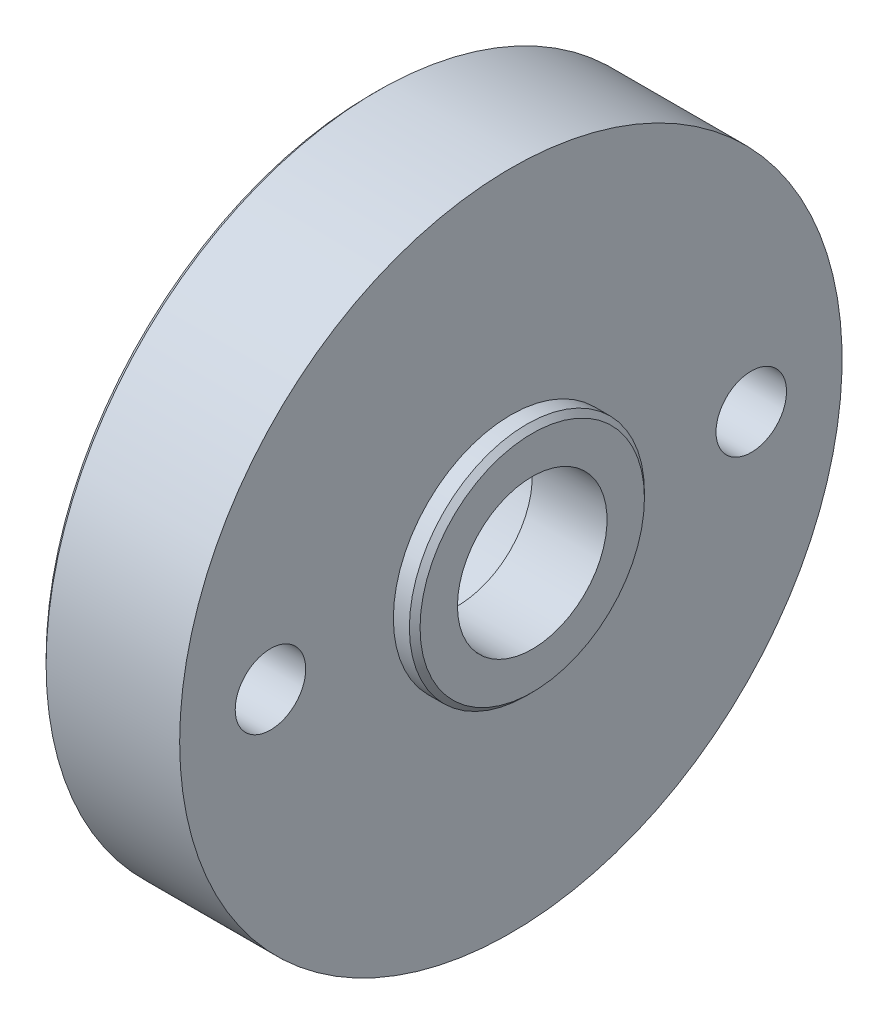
ISO-10303-21;
HEADER;
FILE_DESCRIPTION(('STEP AP214'),'2;1');
FILE_NAME('part.step','',(''),(''),'','','');
FILE_SCHEMA(('AUTOMOTIVE_DESIGN { 1 0 10303 214 1 1 1 1 }'));
ENDSEC;
DATA;
#1=APPLICATION_CONTEXT('core data for automotive mechanical design processes');
#2=APPLICATION_PROTOCOL_DEFINITION('international standard','automotive_design',2000,#1);
#3=PRODUCT_CONTEXT('',#1,'mechanical');
#4=PRODUCT('Part','Part','',(#3));
#5=PRODUCT_RELATED_PRODUCT_CATEGORY('part','',(#4));
#6=PRODUCT_DEFINITION_FORMATION('','',#4);
#7=PRODUCT_DEFINITION_CONTEXT('part definition',#1,'design');
#8=PRODUCT_DEFINITION('design','',#6,#7);
#9=PRODUCT_DEFINITION_SHAPE('','',#8);
#10=(LENGTH_UNIT() NAMED_UNIT(*) SI_UNIT(.MILLI.,.METRE.));
#11=(NAMED_UNIT(*) PLANE_ANGLE_UNIT() SI_UNIT($,.RADIAN.));
#12=(NAMED_UNIT(*) SI_UNIT($,.STERADIAN.) SOLID_ANGLE_UNIT());
#13=UNCERTAINTY_MEASURE_WITH_UNIT(LENGTH_MEASURE(1.E-05),#10,'distance_accuracy_value','');
#14=(GEOMETRIC_REPRESENTATION_CONTEXT(3) GLOBAL_UNCERTAINTY_ASSIGNED_CONTEXT((#13)) GLOBAL_UNIT_ASSIGNED_CONTEXT((#10,
#11,#12)) REPRESENTATION_CONTEXT('',''));
#15=CARTESIAN_POINT('',(0.,0.,0.));
#16=DIRECTION('',(0.,0.,1.));
#17=DIRECTION('',(1.,0.,0.));
#18=AXIS2_PLACEMENT_3D('',#15,#16,#17);
#19=CARTESIAN_POINT('',(0.,0.,0.));
#20=DIRECTION('',(-1.,0.,0.));
#21=DIRECTION('',(0.,0.,1.));
#22=AXIS2_PLACEMENT_3D('',#19,#20,#21);
#23=CYLINDRICAL_SURFACE('',#22,11.);
#24=CARTESIAN_POINT('',(0.499999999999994,0.,0.));
#25=DIRECTION('',(1.,0.,0.));
#26=DIRECTION('',(0.,0.,-1.));
#27=AXIS2_PLACEMENT_3D('',#24,#25,#26);
#28=CIRCLE('',#27,11.);
#29=CARTESIAN_POINT('',(0.499999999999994,0.,-11.));
#30=VERTEX_POINT('',#29);
#31=EDGE_CURVE('E34',#30,#30,#28,.F.);
#32=ORIENTED_EDGE('',*,*,#31,.T.);
#33=EDGE_LOOP('',(#32));
#34=FACE_BOUND('',#33,.T.);
#35=CARTESIAN_POINT('',(8.,0.,0.));
#36=DIRECTION('',(-1.,0.,0.));
#37=DIRECTION('',(0.,0.,1.));
#38=AXIS2_PLACEMENT_3D('',#35,#36,#37);
#39=CIRCLE('',#38,11.);
#40=CARTESIAN_POINT('',(8.,0.,11.));
#41=VERTEX_POINT('',#40);
#42=EDGE_CURVE('E49',#41,#41,#39,.T.);
#43=ORIENTED_EDGE('',*,*,#42,.F.);
#44=EDGE_LOOP('',(#43));
#45=FACE_BOUND('',#44,.T.);
#46=ADVANCED_FACE('F24',(#34,#45),#23,.F.);
#47=CARTESIAN_POINT('',(8.,7.,0.));
#48=DIRECTION('',(1.,0.,0.));
#49=DIRECTION('',(0.,0.,-1.));
#50=AXIS2_PLACEMENT_3D('',#47,#48,#49);
#51=PLANE('',#50);
#52=CARTESIAN_POINT('',(8.,0.,0.));
#53=DIRECTION('',(-1.,0.,0.));
#54=DIRECTION('',(0.,0.,1.));
#55=AXIS2_PLACEMENT_3D('',#52,#53,#54);
#56=CIRCLE('',#55,7.);
#57=CARTESIAN_POINT('',(8.,0.,7.));
#58=VERTEX_POINT('',#57);
#59=EDGE_CURVE('E52',#58,#58,#56,.T.);
#60=ORIENTED_EDGE('',*,*,#59,.F.);
#61=EDGE_LOOP('',(#60));
#62=FACE_BOUND('',#61,.T.);
#63=ORIENTED_EDGE('',*,*,#42,.T.);
#64=EDGE_LOOP('',(#63));
#65=FACE_BOUND('',#64,.T.);
#66=ADVANCED_FACE('F112',(#62,#65),#51,.F.);
#67=CARTESIAN_POINT('',(0.,0.,0.));
#68=DIRECTION('',(-1.,0.,0.));
#69=DIRECTION('',(0.,0.,1.));
#70=AXIS2_PLACEMENT_3D('',#67,#68,#69);
#71=CYLINDRICAL_SURFACE('',#70,7.);
#72=CARTESIAN_POINT('',(15.,0.,0.));
#73=DIRECTION('',(-1.,0.,0.));
#74=DIRECTION('',(0.,0.,1.));
#75=AXIS2_PLACEMENT_3D('',#72,#73,#74);
#76=CIRCLE('',#75,7.);
#77=CARTESIAN_POINT('',(15.,0.,7.));
#78=VERTEX_POINT('',#77);
#79=EDGE_CURVE('E55',#78,#78,#76,.T.);
#80=ORIENTED_EDGE('',*,*,#79,.F.);
#81=EDGE_LOOP('',(#80));
#82=FACE_BOUND('',#81,.T.);
#83=ORIENTED_EDGE('',*,*,#59,.T.);
#84=EDGE_LOOP('',(#83));
#85=FACE_BOUND('',#84,.T.);
#86=ADVANCED_FACE('F116',(#82,#85),#71,.F.);
#87=CARTESIAN_POINT('',(15.,11.,0.));
#88=DIRECTION('',(-1.,0.,0.));
#89=DIRECTION('',(0.,0.,1.));
#90=AXIS2_PLACEMENT_3D('',#87,#88,#89);
#91=PLANE('',#90);
#92=CARTESIAN_POINT('',(15.,0.,0.));
#93=DIRECTION('',(-1.,0.,0.));
#94=DIRECTION('',(0.,0.,1.));
#95=AXIS2_PLACEMENT_3D('',#92,#93,#94);
#96=CIRCLE('',#95,10.5);
#97=CARTESIAN_POINT('',(15.,0.,10.5));
#98=VERTEX_POINT('',#97);
#99=EDGE_CURVE('E10',#98,#98,#96,.F.);
#100=ORIENTED_EDGE('',*,*,#99,.T.);
#101=EDGE_LOOP('',(#100));
#102=FACE_BOUND('',#101,.T.);
#103=ORIENTED_EDGE('',*,*,#79,.T.);
#104=EDGE_LOOP('',(#103));
#105=FACE_BOUND('',#104,.T.);
#106=ADVANCED_FACE('F121',(#102,#105),#91,.F.);
#107=CARTESIAN_POINT('',(0.,0.,0.));
#108=DIRECTION('',(-1.,0.,0.));
#109=DIRECTION('',(0.,0.,1.));
#110=AXIS2_PLACEMENT_3D('',#107,#108,#109);
#111=CYLINDRICAL_SURFACE('',#110,11.);
#112=CARTESIAN_POINT('',(14.5,0.,0.));
#113=DIRECTION('',(-1.,0.,0.));
#114=DIRECTION('',(0.,0.,1.));
#115=AXIS2_PLACEMENT_3D('',#112,#113,#114);
#116=CIRCLE('',#115,11.);
#117=CARTESIAN_POINT('',(14.5,0.,11.));
#118=VERTEX_POINT('',#117);
#119=EDGE_CURVE('E30',#118,#118,#116,.T.);
#120=ORIENTED_EDGE('',*,*,#119,.T.);
#121=EDGE_LOOP('',(#120));
#122=FACE_BOUND('',#121,.T.);
#123=CARTESIAN_POINT('',(13.,0.,0.));
#124=DIRECTION('',(-1.,0.,0.));
#125=DIRECTION('',(0.,0.,1.));
#126=AXIS2_PLACEMENT_3D('',#123,#124,#125);
#127=CIRCLE('',#126,11.);
#128=CARTESIAN_POINT('',(13.,0.,11.));
#129=VERTEX_POINT('',#128);
#130=EDGE_CURVE('E58',#129,#129,#127,.T.);
#131=ORIENTED_EDGE('',*,*,#130,.F.);
#132=EDGE_LOOP('',(#131));
#133=FACE_BOUND('',#132,.T.);
#134=ADVANCED_FACE('F128',(#122,#133),#111,.T.);
#135=CARTESIAN_POINT('',(13.,31.,0.));
#136=DIRECTION('',(-1.,0.,0.));
#137=DIRECTION('',(0.,0.,1.));
#138=AXIS2_PLACEMENT_3D('',#135,#136,#137);
#139=PLANE('',#138);
#140=CARTESIAN_POINT('',(13.,0.,22.5));
#141=DIRECTION('',(-1.,0.,0.));
#142=DIRECTION('',(0.,0.,1.));
#143=AXIS2_PLACEMENT_3D('',#140,#141,#142);
#144=CIRCLE('',#143,3.3);
#145=CARTESIAN_POINT('',(13.,0.,25.8));
#146=VERTEX_POINT('',#145);
#147=EDGE_CURVE('E76',#146,#146,#144,.T.);
#148=ORIENTED_EDGE('',*,*,#147,.T.);
#149=EDGE_LOOP('',(#148));
#150=FACE_BOUND('',#149,.T.);
#151=CARTESIAN_POINT('',(13.,0.,-22.5));
#152=DIRECTION('',(-1.,0.,0.));
#153=DIRECTION('',(0.,0.,1.));
#154=AXIS2_PLACEMENT_3D('',#151,#152,#153);
#155=CIRCLE('',#154,3.3);
#156=CARTESIAN_POINT('',(13.,0.,-19.2));
#157=VERTEX_POINT('',#156);
#158=EDGE_CURVE('E64',#157,#157,#155,.T.);
#159=ORIENTED_EDGE('',*,*,#158,.T.);
#160=EDGE_LOOP('',(#159));
#161=FACE_BOUND('',#160,.T.);
#162=CARTESIAN_POINT('',(13.,0.,0.));
#163=DIRECTION('',(-1.,0.,0.));
#164=DIRECTION('',(0.,0.,1.));
#165=AXIS2_PLACEMENT_3D('',#162,#163,#164);
#166=CIRCLE('',#165,31.);
#167=CARTESIAN_POINT('',(13.,0.,31.));
#168=VERTEX_POINT('',#167);
#169=EDGE_CURVE('E61',#168,#168,#166,.T.);
#170=ORIENTED_EDGE('',*,*,#169,.F.);
#171=EDGE_LOOP('',(#170));
#172=FACE_BOUND('',#171,.T.);
#173=ORIENTED_EDGE('',*,*,#130,.T.);
#174=EDGE_LOOP('',(#173));
#175=FACE_BOUND('',#174,.T.);
#176=ADVANCED_FACE('F131',(#150,#161,#172,#175),#139,.F.);
#177=CARTESIAN_POINT('',(0.,0.,0.));
#178=DIRECTION('',(-1.,0.,0.));
#179=DIRECTION('',(0.,0.,1.));
#180=AXIS2_PLACEMENT_3D('',#177,#178,#179);
#181=CYLINDRICAL_SURFACE('',#180,31.);
#182=CARTESIAN_POINT('',(0.500000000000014,0.,0.));
#183=DIRECTION('',(1.,0.,0.));
#184=DIRECTION('',(0.,0.,-1.));
#185=AXIS2_PLACEMENT_3D('',#182,#183,#184);
#186=CIRCLE('',#185,31.);
#187=CARTESIAN_POINT('',(0.500000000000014,0.,-31.));
#188=VERTEX_POINT('',#187);
#189=EDGE_CURVE('E38',#188,#188,#186,.T.);
#190=ORIENTED_EDGE('',*,*,#189,.T.);
#191=EDGE_LOOP('',(#190));
#192=FACE_BOUND('',#191,.T.);
#193=ORIENTED_EDGE('',*,*,#169,.T.);
#194=EDGE_LOOP('',(#193));
#195=FACE_BOUND('',#194,.T.);
#196=ADVANCED_FACE('F95',(#192,#195),#181,.T.);
#197=CARTESIAN_POINT('',(0.,11.,0.));
#198=DIRECTION('',(1.,0.,0.));
#199=DIRECTION('',(0.,0.,-1.));
#200=AXIS2_PLACEMENT_3D('',#197,#198,#199);
#201=PLANE('',#200);
#202=CARTESIAN_POINT('',(0.,0.,22.5));
#203=DIRECTION('',(-1.,0.,0.));
#204=DIRECTION('',(0.,0.,1.));
#205=AXIS2_PLACEMENT_3D('',#202,#203,#204);
#206=CIRCLE('',#205,6.5);
#207=CARTESIAN_POINT('',(0.,0.,29.));
#208=VERTEX_POINT('',#207);
#209=EDGE_CURVE('E85',#208,#208,#206,.T.);
#210=ORIENTED_EDGE('',*,*,#209,.F.);
#211=EDGE_LOOP('',(#210));
#212=FACE_BOUND('',#211,.T.);
#213=CARTESIAN_POINT('',(0.,0.,-22.5));
#214=DIRECTION('',(-1.,0.,0.));
#215=DIRECTION('',(0.,0.,1.));
#216=AXIS2_PLACEMENT_3D('',#213,#214,#215);
#217=CIRCLE('',#216,6.5);
#218=CARTESIAN_POINT('',(0.,0.,-16.));
#219=VERTEX_POINT('',#218);
#220=EDGE_CURVE('E73',#219,#219,#217,.T.);
#221=ORIENTED_EDGE('',*,*,#220,.F.);
#222=EDGE_LOOP('',(#221));
#223=FACE_BOUND('',#222,.T.);
#224=CARTESIAN_POINT('',(0.,0.,0.));
#225=DIRECTION('',(1.,0.,0.));
#226=DIRECTION('',(0.,0.,-1.));
#227=AXIS2_PLACEMENT_3D('',#224,#225,#226);
#228=CIRCLE('',#227,30.5);
#229=CARTESIAN_POINT('',(0.,0.,-30.5));
#230=VERTEX_POINT('',#229);
#231=EDGE_CURVE('E43',#230,#230,#228,.F.);
#232=ORIENTED_EDGE('',*,*,#231,.T.);
#233=EDGE_LOOP('',(#232));
#234=FACE_BOUND('',#233,.T.);
#235=CARTESIAN_POINT('',(0.,0.,0.));
#236=DIRECTION('',(1.,0.,0.));
#237=DIRECTION('',(0.,0.,-1.));
#238=AXIS2_PLACEMENT_3D('',#235,#236,#237);
#239=CIRCLE('',#238,11.5);
#240=CARTESIAN_POINT('',(0.,0.,-11.5));
#241=VERTEX_POINT('',#240);
#242=EDGE_CURVE('E46',#241,#241,#239,.T.);
#243=ORIENTED_EDGE('',*,*,#242,.T.);
#244=EDGE_LOOP('',(#243));
#245=FACE_BOUND('',#244,.T.);
#246=ADVANCED_FACE('F91',(#212,#223,#234,#245),#201,.F.);
#247=CARTESIAN_POINT('',(0.,0.,0.));
#248=DIRECTION('',(1.,0.,0.));
#249=DIRECTION('',(0.,0.,-1.));
#250=AXIS2_PLACEMENT_3D('',#247,#248,#249);
#251=CONICAL_SURFACE('',#250,30.5,0.785398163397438);
#252=ORIENTED_EDGE('',*,*,#189,.F.);
#253=EDGE_LOOP('',(#252));
#254=FACE_BOUND('',#253,.T.);
#255=ORIENTED_EDGE('',*,*,#231,.F.);
#256=EDGE_LOOP('',(#255));
#257=FACE_BOUND('',#256,.T.);
#258=ADVANCED_FACE('F94',(#254,#257),#251,.T.);
#259=CARTESIAN_POINT('',(0.499999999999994,0.,0.));
#260=DIRECTION('',(-1.,0.,0.));
#261=DIRECTION('',(0.,0.,1.));
#262=AXIS2_PLACEMENT_3D('',#259,#260,#261);
#263=CONICAL_SURFACE('',#262,11.,0.785398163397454);
#264=ORIENTED_EDGE('',*,*,#242,.F.);
#265=EDGE_LOOP('',(#264));
#266=FACE_BOUND('',#265,.T.);
#267=ORIENTED_EDGE('',*,*,#31,.F.);
#268=EDGE_LOOP('',(#267));
#269=FACE_BOUND('',#268,.T.);
#270=ADVANCED_FACE('F103',(#266,#269),#263,.F.);
#271=CARTESIAN_POINT('',(14.5,0.,0.));
#272=DIRECTION('',(-1.,0.,0.));
#273=DIRECTION('',(0.,0.,1.));
#274=AXIS2_PLACEMENT_3D('',#271,#272,#273);
#275=CONICAL_SURFACE('',#274,11.,0.78539816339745);
#276=ORIENTED_EDGE('',*,*,#99,.F.);
#277=EDGE_LOOP('',(#276));
#278=FACE_BOUND('',#277,.T.);
#279=ORIENTED_EDGE('',*,*,#119,.F.);
#280=EDGE_LOOP('',(#279));
#281=FACE_BOUND('',#280,.T.);
#282=ADVANCED_FACE('F106',(#278,#281),#275,.T.);
#283=CARTESIAN_POINT('',(0.,0.,-22.5));
#284=DIRECTION('',(-1.,0.,0.));
#285=DIRECTION('',(0.,0.,1.));
#286=AXIS2_PLACEMENT_3D('',#283,#284,#285);
#287=CYLINDRICAL_SURFACE('',#286,3.3);
#288=ORIENTED_EDGE('',*,*,#158,.F.);
#289=EDGE_LOOP('',(#288));
#290=FACE_BOUND('',#289,.T.);
#291=CARTESIAN_POINT('',(6.6,0.,-22.5));
#292=DIRECTION('',(-1.,0.,0.));
#293=DIRECTION('',(0.,0.,1.));
#294=AXIS2_PLACEMENT_3D('',#291,#292,#293);
#295=CIRCLE('',#294,3.3);
#296=CARTESIAN_POINT('',(6.6,0.,-19.2));
#297=VERTEX_POINT('',#296);
#298=EDGE_CURVE('E67',#297,#297,#295,.T.);
#299=ORIENTED_EDGE('',*,*,#298,.T.);
#300=EDGE_LOOP('',(#299));
#301=FACE_BOUND('',#300,.T.);
#302=ADVANCED_FACE('F143',(#290,#301),#287,.F.);
#303=CARTESIAN_POINT('',(6.6,3.3,-22.5));
#304=DIRECTION('',(1.,0.,0.));
#305=DIRECTION('',(0.,0.,-1.));
#306=AXIS2_PLACEMENT_3D('',#303,#304,#305);
#307=PLANE('',#306);
#308=ORIENTED_EDGE('',*,*,#298,.F.);
#309=EDGE_LOOP('',(#308));
#310=FACE_BOUND('',#309,.T.);
#311=CARTESIAN_POINT('',(6.6,0.,-22.5));
#312=DIRECTION('',(-1.,0.,0.));
#313=DIRECTION('',(0.,0.,1.));
#314=AXIS2_PLACEMENT_3D('',#311,#312,#313);
#315=CIRCLE('',#314,6.5);
#316=CARTESIAN_POINT('',(6.6,0.,-16.));
#317=VERTEX_POINT('',#316);
#318=EDGE_CURVE('E70',#317,#317,#315,.T.);
#319=ORIENTED_EDGE('',*,*,#318,.T.);
#320=EDGE_LOOP('',(#319));
#321=FACE_BOUND('',#320,.T.);
#322=ADVANCED_FACE('F147',(#310,#321),#307,.F.);
#323=CARTESIAN_POINT('',(0.,0.,-22.5));
#324=DIRECTION('',(-1.,0.,0.));
#325=DIRECTION('',(0.,0.,1.));
#326=AXIS2_PLACEMENT_3D('',#323,#324,#325);
#327=CYLINDRICAL_SURFACE('',#326,6.5);
#328=ORIENTED_EDGE('',*,*,#318,.F.);
#329=EDGE_LOOP('',(#328));
#330=FACE_BOUND('',#329,.T.);
#331=ORIENTED_EDGE('',*,*,#220,.T.);
#332=EDGE_LOOP('',(#331));
#333=FACE_BOUND('',#332,.T.);
#334=ADVANCED_FACE('F151',(#330,#333),#327,.F.);
#335=CARTESIAN_POINT('',(0.,0.,22.5));
#336=DIRECTION('',(-1.,0.,0.));
#337=DIRECTION('',(0.,0.,1.));
#338=AXIS2_PLACEMENT_3D('',#335,#336,#337);
#339=CYLINDRICAL_SURFACE('',#338,3.3);
#340=ORIENTED_EDGE('',*,*,#147,.F.);
#341=EDGE_LOOP('',(#340));
#342=FACE_BOUND('',#341,.T.);
#343=CARTESIAN_POINT('',(6.6,0.,22.5));
#344=DIRECTION('',(-1.,0.,0.));
#345=DIRECTION('',(0.,0.,1.));
#346=AXIS2_PLACEMENT_3D('',#343,#344,#345);
#347=CIRCLE('',#346,3.3);
#348=CARTESIAN_POINT('',(6.6,0.,25.8));
#349=VERTEX_POINT('',#348);
#350=EDGE_CURVE('E79',#349,#349,#347,.T.);
#351=ORIENTED_EDGE('',*,*,#350,.T.);
#352=EDGE_LOOP('',(#351));
#353=FACE_BOUND('',#352,.T.);
#354=ADVANCED_FACE('F155',(#342,#353),#339,.F.);
#355=CARTESIAN_POINT('',(6.6,3.3,22.5));
#356=DIRECTION('',(1.,0.,0.));
#357=DIRECTION('',(0.,0.,-1.));
#358=AXIS2_PLACEMENT_3D('',#355,#356,#357);
#359=PLANE('',#358);
#360=ORIENTED_EDGE('',*,*,#350,.F.);
#361=EDGE_LOOP('',(#360));
#362=FACE_BOUND('',#361,.T.);
#363=CARTESIAN_POINT('',(6.6,0.,22.5));
#364=DIRECTION('',(-1.,0.,0.));
#365=DIRECTION('',(0.,0.,1.));
#366=AXIS2_PLACEMENT_3D('',#363,#364,#365);
#367=CIRCLE('',#366,6.5);
#368=CARTESIAN_POINT('',(6.6,0.,29.));
#369=VERTEX_POINT('',#368);
#370=EDGE_CURVE('E82',#369,#369,#367,.T.);
#371=ORIENTED_EDGE('',*,*,#370,.T.);
#372=EDGE_LOOP('',(#371));
#373=FACE_BOUND('',#372,.T.);
#374=ADVANCED_FACE('F159',(#362,#373),#359,.F.);
#375=CARTESIAN_POINT('',(0.,0.,22.5));
#376=DIRECTION('',(-1.,0.,0.));
#377=DIRECTION('',(0.,0.,1.));
#378=AXIS2_PLACEMENT_3D('',#375,#376,#377);
#379=CYLINDRICAL_SURFACE('',#378,6.5);
#380=ORIENTED_EDGE('',*,*,#370,.F.);
#381=EDGE_LOOP('',(#380));
#382=FACE_BOUND('',#381,.T.);
#383=ORIENTED_EDGE('',*,*,#209,.T.);
#384=EDGE_LOOP('',(#383));
#385=FACE_BOUND('',#384,.T.);
#386=ADVANCED_FACE('F89',(#382,#385),#379,.F.);
#387=CLOSED_SHELL('',(#46,#66,#86,#106,#134,#176,#196,#246,#258,#270,#282,#302,#322,#334,#354,
#374,#386));
#388=MANIFOLD_SOLID_BREP('B2',#387);
#389=ADVANCED_BREP_SHAPE_REPRESENTATION('',(#18,#388),#14);
#390=SHAPE_DEFINITION_REPRESENTATION(#9,#389);
ENDSEC;
END-ISO-10303-21;
